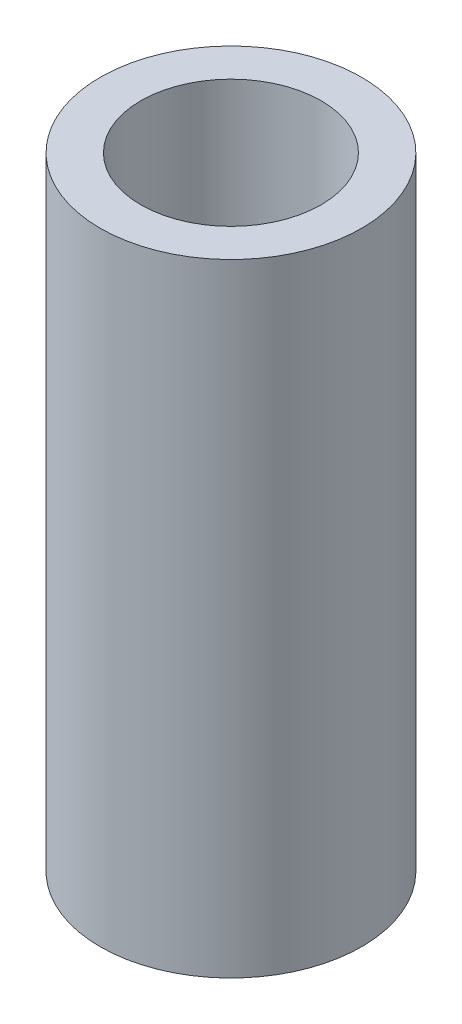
ISO-10303-21;
HEADER;
FILE_DESCRIPTION(('STEP AP214'),'2;1');
FILE_NAME('part.step','',(''),(''),'','','');
FILE_SCHEMA(('AUTOMOTIVE_DESIGN { 1 0 10303 214 1 1 1 1 }'));
ENDSEC;
DATA;
#1=APPLICATION_CONTEXT('core data for automotive mechanical design processes');
#2=APPLICATION_PROTOCOL_DEFINITION('international standard','automotive_design',2000,#1);
#3=PRODUCT_CONTEXT('',#1,'mechanical');
#4=PRODUCT('Part','Part','',(#3));
#5=PRODUCT_RELATED_PRODUCT_CATEGORY('part','',(#4));
#6=PRODUCT_DEFINITION_FORMATION('','',#4);
#7=PRODUCT_DEFINITION_CONTEXT('part definition',#1,'design');
#8=PRODUCT_DEFINITION('design','',#6,#7);
#9=PRODUCT_DEFINITION_SHAPE('','',#8);
#10=(LENGTH_UNIT() NAMED_UNIT(*) SI_UNIT(.MILLI.,.METRE.));
#11=(NAMED_UNIT(*) PLANE_ANGLE_UNIT() SI_UNIT($,.RADIAN.));
#12=(NAMED_UNIT(*) SI_UNIT($,.STERADIAN.) SOLID_ANGLE_UNIT());
#13=UNCERTAINTY_MEASURE_WITH_UNIT(LENGTH_MEASURE(1.E-05),#10,'distance_accuracy_value','');
#14=(GEOMETRIC_REPRESENTATION_CONTEXT(3) GLOBAL_UNCERTAINTY_ASSIGNED_CONTEXT((#13)) GLOBAL_UNIT_ASSIGNED_CONTEXT((#10,
#11,#12)) REPRESENTATION_CONTEXT('',''));
#15=CARTESIAN_POINT('',(0.,0.,0.));
#16=DIRECTION('',(0.,0.,1.));
#17=DIRECTION('',(1.,0.,0.));
#18=AXIS2_PLACEMENT_3D('',#15,#16,#17);
#19=CARTESIAN_POINT('',(0.,17.25,0.));
#20=DIRECTION('',(0.,1.,0.));
#21=DIRECTION('',(0.,0.,1.));
#22=AXIS2_PLACEMENT_3D('',#19,#20,#21);
#23=PLANE('',#22);
#24=CARTESIAN_POINT('',(0.,17.25,0.));
#25=DIRECTION('',(0.,1.,0.));
#26=DIRECTION('',(0.,0.,1.));
#27=AXIS2_PLACEMENT_3D('',#24,#25,#26);
#28=CIRCLE('',#27,7.25);
#29=CARTESIAN_POINT('',(0.,17.25,7.25));
#30=VERTEX_POINT('',#29);
#31=EDGE_CURVE('E10',#30,#30,#28,.T.);
#32=ORIENTED_EDGE('',*,*,#31,.T.);
#33=EDGE_LOOP('',(#32));
#34=FACE_BOUND('',#33,.T.);
#35=CARTESIAN_POINT('',(0.,17.25,0.));
#36=DIRECTION('',(0.,1.,0.));
#37=DIRECTION('',(0.,0.,1.));
#38=AXIS2_PLACEMENT_3D('',#35,#36,#37);
#39=CIRCLE('',#38,5.);
#40=CARTESIAN_POINT('',(0.,17.25,5.));
#41=VERTEX_POINT('',#40);
#42=EDGE_CURVE('E53',#41,#41,#39,.T.);
#43=ORIENTED_EDGE('',*,*,#42,.F.);
#44=EDGE_LOOP('',(#43));
#45=FACE_BOUND('',#44,.T.);
#46=ADVANCED_FACE('F39',(#34,#45),#23,.T.);
#47=CARTESIAN_POINT('',(0.,-17.25,0.));
#48=DIRECTION('',(0.,1.,0.));
#49=DIRECTION('',(0.,0.,1.));
#50=AXIS2_PLACEMENT_3D('',#47,#48,#49);
#51=PLANE('',#50);
#52=CARTESIAN_POINT('',(0.,-17.25,0.));
#53=DIRECTION('',(0.,1.,0.));
#54=DIRECTION('',(0.,0.,1.));
#55=AXIS2_PLACEMENT_3D('',#52,#53,#54);
#56=CIRCLE('',#55,7.25);
#57=CARTESIAN_POINT('',(0.,-17.25,7.25));
#58=VERTEX_POINT('',#57);
#59=EDGE_CURVE('E43',#58,#58,#56,.T.);
#60=ORIENTED_EDGE('',*,*,#59,.F.);
#61=EDGE_LOOP('',(#60));
#62=FACE_BOUND('',#61,.T.);
#63=CARTESIAN_POINT('',(0.,-17.25,0.));
#64=DIRECTION('',(0.,1.,0.));
#65=DIRECTION('',(0.,0.,1.));
#66=AXIS2_PLACEMENT_3D('',#63,#64,#65);
#67=CIRCLE('',#66,5.);
#68=CARTESIAN_POINT('',(0.,-17.25,5.));
#69=VERTEX_POINT('',#68);
#70=EDGE_CURVE('E55',#69,#69,#67,.T.);
#71=ORIENTED_EDGE('',*,*,#70,.T.);
#72=EDGE_LOOP('',(#71));
#73=FACE_BOUND('',#72,.T.);
#74=ADVANCED_FACE('F68',(#62,#73),#51,.F.);
#75=CARTESIAN_POINT('',(0.,17.25,0.));
#76=DIRECTION('',(0.,-1.,0.));
#77=DIRECTION('',(0.,0.,-1.));
#78=AXIS2_PLACEMENT_3D('',#75,#76,#77);
#79=CYLINDRICAL_SURFACE('',#78,7.25);
#80=ORIENTED_EDGE('',*,*,#31,.F.);
#81=EDGE_LOOP('',(#80));
#82=FACE_BOUND('',#81,.T.);
#83=ORIENTED_EDGE('',*,*,#59,.T.);
#84=EDGE_LOOP('',(#83));
#85=FACE_BOUND('',#84,.T.);
#86=ADVANCED_FACE('F41',(#82,#85),#79,.T.);
#87=CARTESIAN_POINT('',(0.,17.25,0.));
#88=DIRECTION('',(0.,-1.,0.));
#89=DIRECTION('',(0.,0.,-1.));
#90=AXIS2_PLACEMENT_3D('',#87,#88,#89);
#91=CYLINDRICAL_SURFACE('',#90,5.);
#92=ORIENTED_EDGE('',*,*,#42,.T.);
#93=EDGE_LOOP('',(#92));
#94=FACE_BOUND('',#93,.T.);
#95=ORIENTED_EDGE('',*,*,#70,.F.);
#96=EDGE_LOOP('',(#95));
#97=FACE_BOUND('',#96,.T.);
#98=ADVANCED_FACE('F64',(#94,#97),#91,.F.);
#99=CLOSED_SHELL('',(#46,#74,#86,#98));
#100=MANIFOLD_SOLID_BREP('B2',#99);
#101=ADVANCED_BREP_SHAPE_REPRESENTATION('',(#18,#100),#14);
#102=SHAPE_DEFINITION_REPRESENTATION(#9,#101);
ENDSEC;
END-ISO-10303-21;
